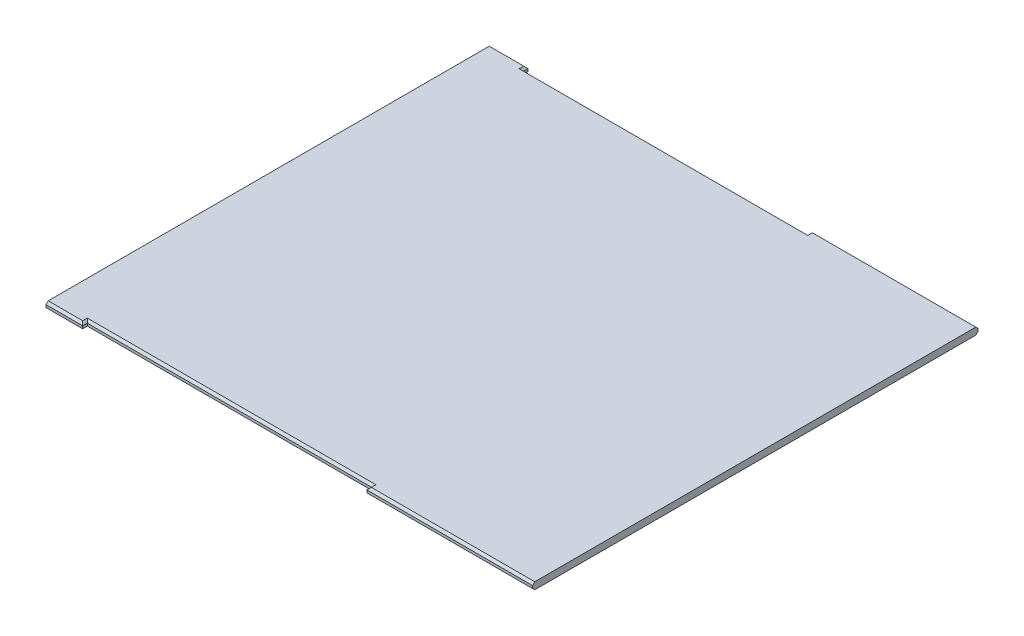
ISO-10303-21;
HEADER;
FILE_DESCRIPTION(('STEP AP214'),'2;1');
FILE_NAME('part.step','',(''),(''),'','','');
FILE_SCHEMA(('AUTOMOTIVE_DESIGN { 1 0 10303 214 1 1 1 1 }'));
ENDSEC;
DATA;
#1=APPLICATION_CONTEXT('core data for automotive mechanical design processes');
#2=APPLICATION_PROTOCOL_DEFINITION('international standard','automotive_design',2000,#1);
#3=PRODUCT_CONTEXT('',#1,'mechanical');
#4=PRODUCT('Part','Part','',(#3));
#5=PRODUCT_RELATED_PRODUCT_CATEGORY('part','',(#4));
#6=PRODUCT_DEFINITION_FORMATION('','',#4);
#7=PRODUCT_DEFINITION_CONTEXT('part definition',#1,'design');
#8=PRODUCT_DEFINITION('design','',#6,#7);
#9=PRODUCT_DEFINITION_SHAPE('','',#8);
#10=(LENGTH_UNIT() NAMED_UNIT(*) SI_UNIT(.MILLI.,.METRE.));
#11=(NAMED_UNIT(*) PLANE_ANGLE_UNIT() SI_UNIT($,.RADIAN.));
#12=(NAMED_UNIT(*) SI_UNIT($,.STERADIAN.) SOLID_ANGLE_UNIT());
#13=UNCERTAINTY_MEASURE_WITH_UNIT(LENGTH_MEASURE(1.E-05),#10,'distance_accuracy_value','');
#14=(GEOMETRIC_REPRESENTATION_CONTEXT(3) GLOBAL_UNCERTAINTY_ASSIGNED_CONTEXT((#13)) GLOBAL_UNIT_ASSIGNED_CONTEXT((#10,
#11,#12)) REPRESENTATION_CONTEXT('',''));
#15=CARTESIAN_POINT('',(0.,0.,0.));
#16=DIRECTION('',(0.,0.,1.));
#17=DIRECTION('',(1.,0.,0.));
#18=AXIS2_PLACEMENT_3D('',#15,#16,#17);
#19=CARTESIAN_POINT('',(-562.573544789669,9.525,-556.126720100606));
#20=DIRECTION('',(-1.,0.,0.));
#21=DIRECTION('',(0.,0.,1.));
#22=AXIS2_PLACEMENT_3D('',#19,#20,#21);
#23=PLANE('',#22);
#24=DIRECTION('',(0.,-1.,0.));
#25=VECTOR('',#24,1.);
#26=CARTESIAN_POINT('',(-562.573544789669,9.525,-556.126720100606));
#27=LINE('',#26,#25);
#28=CARTESIAN_POINT('',(-562.573544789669,3.525,-556.126720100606));
#29=VERTEX_POINT('',#28);
#30=CARTESIAN_POINT('',(-562.573544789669,-3.52499999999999,-556.126720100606));
#31=VERTEX_POINT('',#30);
#32=EDGE_CURVE('E462',#29,#31,#27,.T.);
#33=ORIENTED_EDGE('',*,*,#32,.T.);
#34=DIRECTION('',(0.,0.,-1.));
#35=VECTOR('',#34,1.);
#36=CARTESIAN_POINT('',(-562.573544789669,-3.525,-556.126720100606));
#37=LINE('',#36,#35);
#38=CARTESIAN_POINT('',(-562.573544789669,-3.52499999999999,-568.651720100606));
#39=VERTEX_POINT('',#38);
#40=EDGE_CURVE('E290',#31,#39,#37,.T.);
#41=ORIENTED_EDGE('',*,*,#40,.T.);
#42=DIRECTION('',(0.,-1.,0.));
#43=VECTOR('',#42,1.);
#44=CARTESIAN_POINT('',(-562.573544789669,9.525,-568.651720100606));
#45=LINE('',#44,#43);
#46=CARTESIAN_POINT('',(-562.573544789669,3.525,-568.651720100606));
#47=VERTEX_POINT('',#46);
#48=EDGE_CURVE('E231',#47,#39,#45,.T.);
#49=ORIENTED_EDGE('',*,*,#48,.F.);
#50=DIRECTION('',(0.,0.,1.));
#51=VECTOR('',#50,1.);
#52=CARTESIAN_POINT('',(-562.573544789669,3.525,-556.126720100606));
#53=LINE('',#52,#51);
#54=EDGE_CURVE('E288',#47,#29,#53,.T.);
#55=ORIENTED_EDGE('',*,*,#54,.T.);
#56=EDGE_LOOP('',(#33,#41,#49,#55));
#57=FACE_BOUND('',#56,.T.);
#58=ADVANCED_FACE('F50',(#57),#23,.F.);
#59=CARTESIAN_POINT('',(-562.573544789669,9.525,-568.651720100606));
#60=DIRECTION('',(0.,0.,1.));
#61=DIRECTION('',(1.,0.,0.));
#62=AXIS2_PLACEMENT_3D('',#59,#60,#61);
#63=PLANE('',#62);
#64=ORIENTED_EDGE('',*,*,#48,.T.);
#65=DIRECTION('',(-1.,0.,0.));
#66=VECTOR('',#65,1.);
#67=CARTESIAN_POINT('',(-562.573544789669,-3.525,-568.651720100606));
#68=LINE('',#67,#66);
#69=CARTESIAN_POINT('',(-662.573544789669,-3.52499999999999,-568.651720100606));
#70=VERTEX_POINT('',#69);
#71=EDGE_CURVE('E232',#39,#70,#68,.T.);
#72=ORIENTED_EDGE('',*,*,#71,.T.);
#73=DIRECTION('',(0.,-1.,0.));
#74=VECTOR('',#73,1.);
#75=CARTESIAN_POINT('',(-662.573544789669,9.525,-568.651720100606));
#76=LINE('',#75,#74);
#77=CARTESIAN_POINT('',(-662.573544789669,3.525,-568.651720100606));
#78=VERTEX_POINT('',#77);
#79=EDGE_CURVE('E214',#78,#70,#76,.T.);
#80=ORIENTED_EDGE('',*,*,#79,.F.);
#81=DIRECTION('',(1.,0.,0.));
#82=VECTOR('',#81,1.);
#83=CARTESIAN_POINT('',(-562.573544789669,3.525,-568.651720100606));
#84=LINE('',#83,#82);
#85=EDGE_CURVE('E226',#78,#47,#84,.T.);
#86=ORIENTED_EDGE('',*,*,#85,.T.);
#87=EDGE_LOOP('',(#64,#72,#80,#86));
#88=FACE_BOUND('',#87,.T.);
#89=ADVANCED_FACE('F229',(#88),#63,.F.);
#90=CARTESIAN_POINT('',(-662.573544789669,9.525,644.548279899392));
#91=DIRECTION('',(1.,0.,0.));
#92=DIRECTION('',(0.,0.,-1.));
#93=AXIS2_PLACEMENT_3D('',#90,#91,#92);
#94=PLANE('',#93);
#95=ORIENTED_EDGE('',*,*,#79,.T.);
#96=DIRECTION('',(0.,0.707106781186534,-0.707106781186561));
#97=VECTOR('',#96,1.);
#98=CARTESIAN_POINT('',(-662.573544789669,-3.525,-568.651720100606));
#99=LINE('',#98,#97);
#100=CARTESIAN_POINT('',(-662.573544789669,-9.525,-562.651720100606));
#101=VERTEX_POINT('',#100);
#102=EDGE_CURVE('E224',#70,#101,#99,.F.);
#103=ORIENTED_EDGE('',*,*,#102,.T.);
#104=DIRECTION('',(0.,0.,1.));
#105=VECTOR('',#104,1.);
#106=CARTESIAN_POINT('',(-662.573544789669,-9.525,644.548279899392));
#107=LINE('',#106,#105);
#108=CARTESIAN_POINT('',(-662.573544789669,-9.525,638.548279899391));
#109=VERTEX_POINT('',#108);
#110=EDGE_CURVE('E398',#101,#109,#107,.T.);
#111=ORIENTED_EDGE('',*,*,#110,.T.);
#112=DIRECTION('',(0.,-0.707106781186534,-0.707106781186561));
#113=VECTOR('',#112,1.);
#114=CARTESIAN_POINT('',(-662.573544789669,-3.525,644.548279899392));
#115=LINE('',#114,#113);
#116=CARTESIAN_POINT('',(-662.573544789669,-3.52499999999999,644.548279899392));
#117=VERTEX_POINT('',#116);
#118=EDGE_CURVE('E221',#109,#117,#115,.F.);
#119=ORIENTED_EDGE('',*,*,#118,.T.);
#120=DIRECTION('',(0.,-1.,0.));
#121=VECTOR('',#120,1.);
#122=CARTESIAN_POINT('',(-662.573544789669,9.525,644.548279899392));
#123=LINE('',#122,#121);
#124=CARTESIAN_POINT('',(-662.573544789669,3.525,644.548279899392));
#125=VERTEX_POINT('',#124);
#126=EDGE_CURVE('E237',#125,#117,#123,.T.);
#127=ORIENTED_EDGE('',*,*,#126,.F.);
#128=DIRECTION('',(0.,0.707106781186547,-0.707106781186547));
#129=VECTOR('',#128,1.);
#130=CARTESIAN_POINT('',(-662.573544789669,9.525,638.548279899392));
#131=LINE('',#130,#129);
#132=CARTESIAN_POINT('',(-662.573544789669,9.525,638.548279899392));
#133=VERTEX_POINT('',#132);
#134=EDGE_CURVE('E248',#125,#133,#131,.T.);
#135=ORIENTED_EDGE('',*,*,#134,.T.);
#136=DIRECTION('',(0.,0.,1.));
#137=VECTOR('',#136,1.);
#138=CARTESIAN_POINT('',(-662.573544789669,9.525,644.548279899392));
#139=LINE('',#138,#137);
#140=CARTESIAN_POINT('',(-662.573544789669,9.525,-562.651720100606));
#141=VERTEX_POINT('',#140);
#142=EDGE_CURVE('E220',#141,#133,#139,.T.);
#143=ORIENTED_EDGE('',*,*,#142,.F.);
#144=DIRECTION('',(0.,-0.707106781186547,-0.707106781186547));
#145=VECTOR('',#144,1.);
#146=CARTESIAN_POINT('',(-662.573544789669,9.525,-562.651720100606));
#147=LINE('',#146,#145);
#148=EDGE_CURVE('E215',#141,#78,#147,.T.);
#149=ORIENTED_EDGE('',*,*,#148,.T.);
#150=EDGE_LOOP('',(#95,#103,#111,#119,#127,#135,#143,#149));
#151=FACE_BOUND('',#150,.T.);
#152=ADVANCED_FACE('F212',(#151),#94,.F.);
#153=CARTESIAN_POINT('',(-562.573544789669,9.525,644.548279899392));
#154=DIRECTION('',(0.,0.,-1.));
#155=DIRECTION('',(-1.,0.,0.));
#156=AXIS2_PLACEMENT_3D('',#153,#154,#155);
#157=PLANE('',#156);
#158=ORIENTED_EDGE('',*,*,#126,.T.);
#159=DIRECTION('',(1.,0.,0.));
#160=VECTOR('',#159,1.);
#161=CARTESIAN_POINT('',(-562.573544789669,-3.525,644.548279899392));
#162=LINE('',#161,#160);
#163=CARTESIAN_POINT('',(-562.573544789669,-3.52499999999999,644.548279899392));
#164=VERTEX_POINT('',#163);
#165=EDGE_CURVE('E358',#117,#164,#162,.T.);
#166=ORIENTED_EDGE('',*,*,#165,.T.);
#167=DIRECTION('',(0.,-1.,0.));
#168=VECTOR('',#167,1.);
#169=CARTESIAN_POINT('',(-562.573544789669,9.525,644.548279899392));
#170=LINE('',#169,#168);
#171=CARTESIAN_POINT('',(-562.573544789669,3.525,644.548279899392));
#172=VERTEX_POINT('',#171);
#173=EDGE_CURVE('E498',#172,#164,#170,.T.);
#174=ORIENTED_EDGE('',*,*,#173,.F.);
#175=DIRECTION('',(-1.,0.,0.));
#176=VECTOR('',#175,1.);
#177=CARTESIAN_POINT('',(-662.573544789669,3.525,644.548279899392));
#178=LINE('',#177,#176);
#179=EDGE_CURVE('E353',#172,#125,#178,.T.);
#180=ORIENTED_EDGE('',*,*,#179,.T.);
#181=EDGE_LOOP('',(#158,#166,#174,#180));
#182=FACE_BOUND('',#181,.T.);
#183=ADVANCED_FACE('F510',(#182),#157,.F.);
#184=CARTESIAN_POINT('',(-562.573544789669,9.525,632.023279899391));
#185=DIRECTION('',(-1.,0.,0.));
#186=DIRECTION('',(0.,0.,1.));
#187=AXIS2_PLACEMENT_3D('',#184,#185,#186);
#188=PLANE('',#187);
#189=ORIENTED_EDGE('',*,*,#173,.T.);
#190=DIRECTION('',(0.,0.,-1.));
#191=VECTOR('',#190,1.);
#192=CARTESIAN_POINT('',(-562.573544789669,-3.525,632.023279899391));
#193=LINE('',#192,#191);
#194=CARTESIAN_POINT('',(-562.573544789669,-3.52499999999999,632.023279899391));
#195=VERTEX_POINT('',#194);
#196=EDGE_CURVE('E361',#164,#195,#193,.T.);
#197=ORIENTED_EDGE('',*,*,#196,.T.);
#198=DIRECTION('',(0.,-1.,0.));
#199=VECTOR('',#198,1.);
#200=CARTESIAN_POINT('',(-562.573544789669,9.525,632.023279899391));
#201=LINE('',#200,#199);
#202=CARTESIAN_POINT('',(-562.573544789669,3.525,632.023279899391));
#203=VERTEX_POINT('',#202);
#204=EDGE_CURVE('E497',#203,#195,#201,.T.);
#205=ORIENTED_EDGE('',*,*,#204,.F.);
#206=DIRECTION('',(0.,0.,1.));
#207=VECTOR('',#206,1.);
#208=CARTESIAN_POINT('',(-562.573544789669,3.525,644.548279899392));
#209=LINE('',#208,#207);
#210=EDGE_CURVE('E356',#203,#172,#209,.T.);
#211=ORIENTED_EDGE('',*,*,#210,.T.);
#212=EDGE_LOOP('',(#189,#197,#205,#211));
#213=FACE_BOUND('',#212,.T.);
#214=ADVANCED_FACE('F521',(#213),#188,.F.);
#215=CARTESIAN_POINT('',(211.426455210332,9.525,632.023279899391));
#216=DIRECTION('',(0.,0.,-1.));
#217=DIRECTION('',(-1.,0.,0.));
#218=AXIS2_PLACEMENT_3D('',#215,#216,#217);
#219=PLANE('',#218);
#220=ORIENTED_EDGE('',*,*,#204,.T.);
#221=DIRECTION('',(1.,0.,0.));
#222=VECTOR('',#221,1.);
#223=CARTESIAN_POINT('',(211.426455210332,-3.525,632.023279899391));
#224=LINE('',#223,#222);
#225=CARTESIAN_POINT('',(211.426455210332,-3.52499999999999,632.023279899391));
#226=VERTEX_POINT('',#225);
#227=EDGE_CURVE('E369',#195,#226,#224,.T.);
#228=ORIENTED_EDGE('',*,*,#227,.T.);
#229=DIRECTION('',(0.,-1.,0.));
#230=VECTOR('',#229,1.);
#231=CARTESIAN_POINT('',(211.426455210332,9.525,632.023279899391));
#232=LINE('',#231,#230);
#233=CARTESIAN_POINT('',(211.426455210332,3.525,632.023279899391));
#234=VERTEX_POINT('',#233);
#235=EDGE_CURVE('E492',#234,#226,#232,.T.);
#236=ORIENTED_EDGE('',*,*,#235,.F.);
#237=DIRECTION('',(-1.,0.,0.));
#238=VECTOR('',#237,1.);
#239=CARTESIAN_POINT('',(-562.573544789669,3.525,632.023279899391));
#240=LINE('',#239,#238);
#241=EDGE_CURVE('E368',#234,#203,#240,.T.);
#242=ORIENTED_EDGE('',*,*,#241,.T.);
#243=EDGE_LOOP('',(#220,#228,#236,#242));
#244=FACE_BOUND('',#243,.T.);
#245=ADVANCED_FACE('F530',(#244),#219,.F.);
#246=CARTESIAN_POINT('',(211.426455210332,9.525,632.023279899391));
#247=DIRECTION('',(1.,0.,0.));
#248=DIRECTION('',(0.,0.,-1.));
#249=AXIS2_PLACEMENT_3D('',#246,#247,#248);
#250=PLANE('',#249);
#251=ORIENTED_EDGE('',*,*,#235,.T.);
#252=DIRECTION('',(0.,0.,1.));
#253=VECTOR('',#252,1.);
#254=CARTESIAN_POINT('',(211.426455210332,-3.525,632.023279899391));
#255=LINE('',#254,#253);
#256=CARTESIAN_POINT('',(211.426455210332,-3.52499999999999,644.548279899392));
#257=VERTEX_POINT('',#256);
#258=EDGE_CURVE('E68',#226,#257,#255,.T.);
#259=ORIENTED_EDGE('',*,*,#258,.T.);
#260=DIRECTION('',(0.,-1.,0.));
#261=VECTOR('',#260,1.);
#262=CARTESIAN_POINT('',(211.426455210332,9.525,644.548279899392));
#263=LINE('',#262,#261);
#264=CARTESIAN_POINT('',(211.426455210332,3.525,644.548279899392));
#265=VERTEX_POINT('',#264);
#266=EDGE_CURVE('E489',#265,#257,#263,.T.);
#267=ORIENTED_EDGE('',*,*,#266,.F.);
#268=DIRECTION('',(0.,0.,-1.));
#269=VECTOR('',#268,1.);
#270=CARTESIAN_POINT('',(211.426455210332,3.525,632.023279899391));
#271=LINE('',#270,#269);
#272=EDGE_CURVE('E375',#265,#234,#271,.T.);
#273=ORIENTED_EDGE('',*,*,#272,.T.);
#274=EDGE_LOOP('',(#251,#259,#267,#273));
#275=FACE_BOUND('',#274,.T.);
#276=ADVANCED_FACE('F837',(#275),#250,.F.);
#277=CARTESIAN_POINT('',(211.426455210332,9.525,644.548279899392));
#278=DIRECTION('',(0.,0.,-1.));
#279=DIRECTION('',(-1.,0.,0.));
#280=AXIS2_PLACEMENT_3D('',#277,#278,#279);
#281=PLANE('',#280);
#282=ORIENTED_EDGE('',*,*,#266,.T.);
#283=DIRECTION('',(1.,0.,0.));
#284=VECTOR('',#283,1.);
#285=CARTESIAN_POINT('',(211.426455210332,-3.525,644.548279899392));
#286=LINE('',#285,#284);
#287=CARTESIAN_POINT('',(662.626455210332,-3.52499999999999,644.548279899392));
#288=VERTEX_POINT('',#287);
#289=EDGE_CURVE('E11',#257,#288,#286,.T.);
#290=ORIENTED_EDGE('',*,*,#289,.T.);
#291=DIRECTION('',(0.,-1.,0.));
#292=VECTOR('',#291,1.);
#293=CARTESIAN_POINT('',(662.626455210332,9.525,644.548279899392));
#294=LINE('',#293,#292);
#295=CARTESIAN_POINT('',(662.626455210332,3.525,644.548279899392));
#296=VERTEX_POINT('',#295);
#297=EDGE_CURVE('E490',#296,#288,#294,.T.);
#298=ORIENTED_EDGE('',*,*,#297,.F.);
#299=DIRECTION('',(-1.,0.,0.));
#300=VECTOR('',#299,1.);
#301=CARTESIAN_POINT('',(211.426455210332,3.525,644.548279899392));
#302=LINE('',#301,#300);
#303=EDGE_CURVE('E59',#296,#265,#302,.T.);
#304=ORIENTED_EDGE('',*,*,#303,.T.);
#305=EDGE_LOOP('',(#282,#290,#298,#304));
#306=FACE_BOUND('',#305,.T.);
#307=ADVANCED_FACE('F542',(#306),#281,.F.);
#308=CARTESIAN_POINT('',(662.626455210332,9.525,644.548279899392));
#309=DIRECTION('',(-1.,0.,0.));
#310=DIRECTION('',(0.,0.,1.));
#311=AXIS2_PLACEMENT_3D('',#308,#309,#310);
#312=PLANE('',#311);
#313=DIRECTION('',(0.,0.,-1.));
#314=VECTOR('',#313,1.);
#315=CARTESIAN_POINT('',(662.626455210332,-9.525,644.548279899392));
#316=LINE('',#315,#314);
#317=CARTESIAN_POINT('',(662.626455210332,-9.525,638.548279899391));
#318=VERTEX_POINT('',#317);
#319=CARTESIAN_POINT('',(662.626455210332,-9.525,-562.651720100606));
#320=VERTEX_POINT('',#319);
#321=EDGE_CURVE('E467',#318,#320,#316,.T.);
#322=ORIENTED_EDGE('',*,*,#321,.T.);
#323=DIRECTION('',(0.,-0.707106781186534,0.707106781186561));
#324=VECTOR('',#323,1.);
#325=CARTESIAN_POINT('',(662.626455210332,-3.525,-568.651720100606));
#326=LINE('',#325,#324);
#327=CARTESIAN_POINT('',(662.626455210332,-3.52499999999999,-568.651720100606));
#328=VERTEX_POINT('',#327);
#329=EDGE_CURVE('E317',#320,#328,#326,.F.);
#330=ORIENTED_EDGE('',*,*,#329,.T.);
#331=DIRECTION('',(0.,-1.,0.));
#332=VECTOR('',#331,1.);
#333=CARTESIAN_POINT('',(662.626455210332,9.525,-568.651720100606));
#334=LINE('',#333,#332);
#335=CARTESIAN_POINT('',(662.626455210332,3.525,-568.651720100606));
#336=VERTEX_POINT('',#335);
#337=EDGE_CURVE('E483',#336,#328,#334,.T.);
#338=ORIENTED_EDGE('',*,*,#337,.F.);
#339=DIRECTION('',(0.,0.707106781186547,0.707106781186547));
#340=VECTOR('',#339,1.);
#341=CARTESIAN_POINT('',(662.626455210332,9.525,-562.651720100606));
#342=LINE('',#341,#340);
#343=CARTESIAN_POINT('',(662.626455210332,9.525,-562.651720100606));
#344=VERTEX_POINT('',#343);
#345=EDGE_CURVE('E316',#336,#344,#342,.T.);
#346=ORIENTED_EDGE('',*,*,#345,.T.);
#347=DIRECTION('',(0.,0.,-1.));
#348=VECTOR('',#347,1.);
#349=CARTESIAN_POINT('',(662.626455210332,9.525,644.548279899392));
#350=LINE('',#349,#348);
#351=CARTESIAN_POINT('',(662.626455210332,9.525,638.548279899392));
#352=VERTEX_POINT('',#351);
#353=EDGE_CURVE('E454',#352,#344,#350,.T.);
#354=ORIENTED_EDGE('',*,*,#353,.F.);
#355=DIRECTION('',(0.,-0.707106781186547,0.707106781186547));
#356=VECTOR('',#355,1.);
#357=CARTESIAN_POINT('',(662.626455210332,9.525,638.548279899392));
#358=LINE('',#357,#356);
#359=EDGE_CURVE('E309',#352,#296,#358,.T.);
#360=ORIENTED_EDGE('',*,*,#359,.T.);
#361=ORIENTED_EDGE('',*,*,#297,.T.);
#362=DIRECTION('',(0.,0.707106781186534,0.707106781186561));
#363=VECTOR('',#362,1.);
#364=CARTESIAN_POINT('',(662.626455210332,-3.525,644.548279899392));
#365=LINE('',#364,#363);
#366=EDGE_CURVE('E311',#288,#318,#365,.F.);
#367=ORIENTED_EDGE('',*,*,#366,.T.);
#368=EDGE_LOOP('',(#322,#330,#338,#346,#354,#360,#361,#367));
#369=FACE_BOUND('',#368,.T.);
#370=ADVANCED_FACE('F457',(#369),#312,.F.);
#371=CARTESIAN_POINT('',(211.426455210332,9.525,-568.651720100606));
#372=DIRECTION('',(0.,0.,1.));
#373=DIRECTION('',(1.,0.,0.));
#374=AXIS2_PLACEMENT_3D('',#371,#372,#373);
#375=PLANE('',#374);
#376=ORIENTED_EDGE('',*,*,#337,.T.);
#377=DIRECTION('',(-1.,0.,0.));
#378=VECTOR('',#377,1.);
#379=CARTESIAN_POINT('',(211.426455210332,-3.525,-568.651720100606));
#380=LINE('',#379,#378);
#381=CARTESIAN_POINT('',(211.426455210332,-3.52499999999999,-568.651720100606));
#382=VERTEX_POINT('',#381);
#383=EDGE_CURVE('E307',#328,#382,#380,.T.);
#384=ORIENTED_EDGE('',*,*,#383,.T.);
#385=DIRECTION('',(0.,-1.,0.));
#386=VECTOR('',#385,1.);
#387=CARTESIAN_POINT('',(211.426455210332,9.525,-568.651720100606));
#388=LINE('',#387,#386);
#389=CARTESIAN_POINT('',(211.426455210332,3.525,-568.651720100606));
#390=VERTEX_POINT('',#389);
#391=EDGE_CURVE('E479',#390,#382,#388,.T.);
#392=ORIENTED_EDGE('',*,*,#391,.F.);
#393=DIRECTION('',(1.,0.,0.));
#394=VECTOR('',#393,1.);
#395=CARTESIAN_POINT('',(662.626455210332,3.525,-568.651720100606));
#396=LINE('',#395,#394);
#397=EDGE_CURVE('E305',#390,#336,#396,.T.);
#398=ORIENTED_EDGE('',*,*,#397,.T.);
#399=EDGE_LOOP('',(#376,#384,#392,#398));
#400=FACE_BOUND('',#399,.T.);
#401=ADVANCED_FACE('F584',(#400),#375,.F.);
#402=CARTESIAN_POINT('',(211.426455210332,9.525,-556.126720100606));
#403=DIRECTION('',(1.,0.,0.));
#404=DIRECTION('',(0.,0.,-1.));
#405=AXIS2_PLACEMENT_3D('',#402,#403,#404);
#406=PLANE('',#405);
#407=ORIENTED_EDGE('',*,*,#391,.T.);
#408=DIRECTION('',(0.,0.,1.));
#409=VECTOR('',#408,1.);
#410=CARTESIAN_POINT('',(211.426455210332,-3.525,-556.126720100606));
#411=LINE('',#410,#409);
#412=CARTESIAN_POINT('',(211.426455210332,-3.52499999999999,-556.126720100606));
#413=VERTEX_POINT('',#412);
#414=EDGE_CURVE('E303',#382,#413,#411,.T.);
#415=ORIENTED_EDGE('',*,*,#414,.T.);
#416=DIRECTION('',(0.,-1.,0.));
#417=VECTOR('',#416,1.);
#418=CARTESIAN_POINT('',(211.426455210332,9.525,-556.126720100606));
#419=LINE('',#418,#417);
#420=CARTESIAN_POINT('',(211.426455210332,3.525,-556.126720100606));
#421=VERTEX_POINT('',#420);
#422=EDGE_CURVE('E468',#421,#413,#419,.T.);
#423=ORIENTED_EDGE('',*,*,#422,.F.);
#424=DIRECTION('',(0.,0.,-1.));
#425=VECTOR('',#424,1.);
#426=CARTESIAN_POINT('',(211.426455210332,3.525,-568.651720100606));
#427=LINE('',#426,#425);
#428=EDGE_CURVE('E298',#421,#390,#427,.T.);
#429=ORIENTED_EDGE('',*,*,#428,.T.);
#430=EDGE_LOOP('',(#407,#415,#423,#429));
#431=FACE_BOUND('',#430,.T.);
#432=ADVANCED_FACE('F562',(#431),#406,.F.);
#433=CARTESIAN_POINT('',(211.426455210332,9.525,-556.126720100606));
#434=DIRECTION('',(0.,0.,1.));
#435=DIRECTION('',(1.,0.,0.));
#436=AXIS2_PLACEMENT_3D('',#433,#434,#435);
#437=PLANE('',#436);
#438=ORIENTED_EDGE('',*,*,#422,.T.);
#439=DIRECTION('',(-1.,0.,0.));
#440=VECTOR('',#439,1.);
#441=CARTESIAN_POINT('',(211.426455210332,-3.525,-556.126720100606));
#442=LINE('',#441,#440);
#443=EDGE_CURVE('E293',#413,#31,#442,.T.);
#444=ORIENTED_EDGE('',*,*,#443,.T.);
#445=ORIENTED_EDGE('',*,*,#32,.F.);
#446=DIRECTION('',(1.,0.,0.));
#447=VECTOR('',#446,1.);
#448=CARTESIAN_POINT('',(211.426455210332,3.525,-556.126720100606));
#449=LINE('',#448,#447);
#450=EDGE_CURVE('E295',#29,#421,#449,.T.);
#451=ORIENTED_EDGE('',*,*,#450,.T.);
#452=EDGE_LOOP('',(#438,#444,#445,#451));
#453=FACE_BOUND('',#452,.T.);
#454=ADVANCED_FACE('F570',(#453),#437,.F.);
#455=CARTESIAN_POINT('',(0.,9.525,0.));
#456=DIRECTION('',(0.,1.,0.));
#457=DIRECTION('',(0.,0.,1.));
#458=AXIS2_PLACEMENT_3D('',#455,#456,#457);
#459=PLANE('',#458);
#460=DIRECTION('',(0.,0.,-1.));
#461=VECTOR('',#460,1.);
#462=CARTESIAN_POINT('',(-568.573544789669,9.525,-568.651720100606));
#463=LINE('',#462,#461);
#464=CARTESIAN_POINT('',(-568.573544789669,9.525,-550.126720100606));
#465=VERTEX_POINT('',#464);
#466=CARTESIAN_POINT('',(-568.573544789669,9.525,-562.651720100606));
#467=VERTEX_POINT('',#466);
#468=EDGE_CURVE('E350',#465,#467,#463,.T.);
#469=ORIENTED_EDGE('',*,*,#468,.T.);
#470=DIRECTION('',(-1.,0.,0.));
#471=VECTOR('',#470,1.);
#472=CARTESIAN_POINT('',(-662.573544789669,9.525,-562.651720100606));
#473=LINE('',#472,#471);
#474=EDGE_CURVE('E348',#467,#141,#473,.T.);
#475=ORIENTED_EDGE('',*,*,#474,.T.);
#476=ORIENTED_EDGE('',*,*,#142,.T.);
#477=DIRECTION('',(1.,0.,0.));
#478=VECTOR('',#477,1.);
#479=CARTESIAN_POINT('',(-562.573544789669,9.525,638.548279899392));
#480=LINE('',#479,#478);
#481=CARTESIAN_POINT('',(-568.573544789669,9.525,638.548279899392));
#482=VERTEX_POINT('',#481);
#483=EDGE_CURVE('E331',#133,#482,#480,.T.);
#484=ORIENTED_EDGE('',*,*,#483,.T.);
#485=DIRECTION('',(0.,0.,-1.));
#486=VECTOR('',#485,1.);
#487=CARTESIAN_POINT('',(-568.573544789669,9.525,632.023279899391));
#488=LINE('',#487,#486);
#489=CARTESIAN_POINT('',(-568.573544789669,9.525,626.023279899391));
#490=VERTEX_POINT('',#489);
#491=EDGE_CURVE('E332',#482,#490,#488,.T.);
#492=ORIENTED_EDGE('',*,*,#491,.T.);
#493=DIRECTION('',(1.,0.,0.));
#494=VECTOR('',#493,1.);
#495=CARTESIAN_POINT('',(211.426455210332,9.525,626.023279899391));
#496=LINE('',#495,#494);
#497=CARTESIAN_POINT('',(217.426455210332,9.525,626.023279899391));
#498=VERTEX_POINT('',#497);
#499=EDGE_CURVE('E327',#490,#498,#496,.T.);
#500=ORIENTED_EDGE('',*,*,#499,.T.);
#501=DIRECTION('',(0.,0.,1.));
#502=VECTOR('',#501,1.);
#503=CARTESIAN_POINT('',(217.426455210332,9.525,644.548279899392));
#504=LINE('',#503,#502);
#505=CARTESIAN_POINT('',(217.426455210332,9.525,638.548279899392));
#506=VERTEX_POINT('',#505);
#507=EDGE_CURVE('E324',#498,#506,#504,.T.);
#508=ORIENTED_EDGE('',*,*,#507,.T.);
#509=DIRECTION('',(1.,0.,0.));
#510=VECTOR('',#509,1.);
#511=CARTESIAN_POINT('',(662.626455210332,9.525,638.548279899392));
#512=LINE('',#511,#510);
#513=EDGE_CURVE('E325',#506,#352,#512,.T.);
#514=ORIENTED_EDGE('',*,*,#513,.T.);
#515=ORIENTED_EDGE('',*,*,#353,.T.);
#516=DIRECTION('',(-1.,0.,0.));
#517=VECTOR('',#516,1.);
#518=CARTESIAN_POINT('',(211.426455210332,9.525,-562.651720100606));
#519=LINE('',#518,#517);
#520=CARTESIAN_POINT('',(217.426455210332,9.525,-562.651720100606));
#521=VERTEX_POINT('',#520);
#522=EDGE_CURVE('E343',#344,#521,#519,.T.);
#523=ORIENTED_EDGE('',*,*,#522,.T.);
#524=DIRECTION('',(0.,0.,1.));
#525=VECTOR('',#524,1.);
#526=CARTESIAN_POINT('',(217.426455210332,9.525,-556.126720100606));
#527=LINE('',#526,#525);
#528=CARTESIAN_POINT('',(217.426455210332,9.525,-550.126720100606));
#529=VERTEX_POINT('',#528);
#530=EDGE_CURVE('E338',#521,#529,#527,.T.);
#531=ORIENTED_EDGE('',*,*,#530,.T.);
#532=DIRECTION('',(-1.,0.,0.));
#533=VECTOR('',#532,1.);
#534=CARTESIAN_POINT('',(-562.573544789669,9.525,-550.126720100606));
#535=LINE('',#534,#533);
#536=EDGE_CURVE('E345',#529,#465,#535,.T.);
#537=ORIENTED_EDGE('',*,*,#536,.T.);
#538=EDGE_LOOP('',(#469,#475,#476,#484,#492,#500,#508,#514,#515,#523,#531,#537));
#539=FACE_BOUND('',#538,.T.);
#540=ADVANCED_FACE('F453',(#539),#459,.T.);
#541=CARTESIAN_POINT('',(0.,-9.525,0.));
#542=DIRECTION('',(0.,1.,0.));
#543=DIRECTION('',(0.,0.,1.));
#544=AXIS2_PLACEMENT_3D('',#541,#542,#543);
#545=PLANE('',#544);
#546=ORIENTED_EDGE('',*,*,#110,.F.);
#547=DIRECTION('',(1.,0.,0.));
#548=VECTOR('',#547,1.);
#549=CARTESIAN_POINT('',(0.,-9.525,-562.651720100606));
#550=LINE('',#549,#548);
#551=CARTESIAN_POINT('',(-568.573544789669,-9.525,-562.651720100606));
#552=VERTEX_POINT('',#551);
#553=EDGE_CURVE('E283',#101,#552,#550,.T.);
#554=ORIENTED_EDGE('',*,*,#553,.T.);
#555=DIRECTION('',(0.,0.,1.));
#556=VECTOR('',#555,1.);
#557=CARTESIAN_POINT('',(-568.573544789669,-9.525,0.));
#558=LINE('',#557,#556);
#559=CARTESIAN_POINT('',(-568.573544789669,-9.525,-550.126720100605));
#560=VERTEX_POINT('',#559);
#561=EDGE_CURVE('E278',#552,#560,#558,.T.);
#562=ORIENTED_EDGE('',*,*,#561,.T.);
#563=DIRECTION('',(1.,0.,0.));
#564=VECTOR('',#563,1.);
#565=CARTESIAN_POINT('',(0.,-9.525,-550.126720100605));
#566=LINE('',#565,#564);
#567=CARTESIAN_POINT('',(217.426455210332,-9.525,-550.126720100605));
#568=VERTEX_POINT('',#567);
#569=EDGE_CURVE('E280',#560,#568,#566,.T.);
#570=ORIENTED_EDGE('',*,*,#569,.T.);
#571=DIRECTION('',(0.,0.,-1.));
#572=VECTOR('',#571,1.);
#573=CARTESIAN_POINT('',(217.426455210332,-9.525,0.));
#574=LINE('',#573,#572);
#575=CARTESIAN_POINT('',(217.426455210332,-9.525,-562.651720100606));
#576=VERTEX_POINT('',#575);
#577=EDGE_CURVE('E273',#568,#576,#574,.T.);
#578=ORIENTED_EDGE('',*,*,#577,.T.);
#579=DIRECTION('',(1.,0.,0.));
#580=VECTOR('',#579,1.);
#581=CARTESIAN_POINT('',(0.,-9.525,-562.651720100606));
#582=LINE('',#581,#580);
#583=EDGE_CURVE('E271',#576,#320,#582,.T.);
#584=ORIENTED_EDGE('',*,*,#583,.T.);
#585=ORIENTED_EDGE('',*,*,#321,.F.);
#586=DIRECTION('',(-1.,0.,0.));
#587=VECTOR('',#586,1.);
#588=CARTESIAN_POINT('',(0.,-9.525,638.548279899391));
#589=LINE('',#588,#587);
#590=CARTESIAN_POINT('',(217.426455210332,-9.525,638.548279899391));
#591=VERTEX_POINT('',#590);
#592=EDGE_CURVE('E258',#318,#591,#589,.T.);
#593=ORIENTED_EDGE('',*,*,#592,.T.);
#594=DIRECTION('',(0.,0.,-1.));
#595=VECTOR('',#594,1.);
#596=CARTESIAN_POINT('',(217.426455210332,-9.525,0.));
#597=LINE('',#596,#595);
#598=CARTESIAN_POINT('',(217.426455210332,-9.525,626.023279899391));
#599=VERTEX_POINT('',#598);
#600=EDGE_CURVE('E259',#591,#599,#597,.T.);
#601=ORIENTED_EDGE('',*,*,#600,.T.);
#602=DIRECTION('',(-1.,0.,0.));
#603=VECTOR('',#602,1.);
#604=CARTESIAN_POINT('',(0.,-9.525,626.023279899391));
#605=LINE('',#604,#603);
#606=CARTESIAN_POINT('',(-568.573544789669,-9.525,626.023279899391));
#607=VERTEX_POINT('',#606);
#608=EDGE_CURVE('E265',#599,#607,#605,.T.);
#609=ORIENTED_EDGE('',*,*,#608,.T.);
#610=DIRECTION('',(0.,0.,1.));
#611=VECTOR('',#610,1.);
#612=CARTESIAN_POINT('',(-568.573544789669,-9.525,0.));
#613=LINE('',#612,#611);
#614=CARTESIAN_POINT('',(-568.573544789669,-9.525,638.548279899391));
#615=VERTEX_POINT('',#614);
#616=EDGE_CURVE('E264',#607,#615,#613,.T.);
#617=ORIENTED_EDGE('',*,*,#616,.T.);
#618=DIRECTION('',(-1.,0.,0.));
#619=VECTOR('',#618,1.);
#620=CARTESIAN_POINT('',(0.,-9.525,638.548279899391));
#621=LINE('',#620,#619);
#622=EDGE_CURVE('E268',#615,#109,#621,.T.);
#623=ORIENTED_EDGE('',*,*,#622,.T.);
#624=EDGE_LOOP('',(#546,#554,#562,#570,#578,#584,#585,#593,#601,#609,#617,#623));
#625=FACE_BOUND('',#624,.T.);
#626=ADVANCED_FACE('F548',(#625),#545,.F.);
#627=CARTESIAN_POINT('',(211.426455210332,-3.525,-568.651720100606));
#628=DIRECTION('',(0.,0.707106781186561,0.707106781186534));
#629=DIRECTION('',(-1.,0.,0.));
#630=AXIS2_PLACEMENT_3D('',#627,#628,#629);
#631=PLANE('',#630);
#632=ORIENTED_EDGE('',*,*,#329,.F.);
#633=ORIENTED_EDGE('',*,*,#583,.F.);
#634=DIRECTION('',(-0.577350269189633,0.577350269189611,-0.577350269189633));
#635=VECTOR('',#634,1.);
#636=CARTESIAN_POINT('',(211.426455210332,-3.525,-568.651720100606));
#637=LINE('',#636,#635);
#638=EDGE_CURVE('E395',#382,#576,#637,.F.);
#639=ORIENTED_EDGE('',*,*,#638,.F.);
#640=ORIENTED_EDGE('',*,*,#383,.F.);
#641=EDGE_LOOP('',(#632,#633,#639,#640));
#642=FACE_BOUND('',#641,.T.);
#643=ADVANCED_FACE('F551',(#642),#631,.F.);
#644=CARTESIAN_POINT('',(211.426455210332,-3.525,-556.126720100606));
#645=DIRECTION('',(0.707106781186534,0.707106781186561,0.));
#646=DIRECTION('',(0.,0.,1.));
#647=AXIS2_PLACEMENT_3D('',#644,#645,#646);
#648=PLANE('',#647);
#649=ORIENTED_EDGE('',*,*,#638,.T.);
#650=ORIENTED_EDGE('',*,*,#577,.F.);
#651=DIRECTION('',(-0.577350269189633,0.577350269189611,-0.577350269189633));
#652=VECTOR('',#651,1.);
#653=CARTESIAN_POINT('',(211.426455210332,-3.525,-556.126720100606));
#654=LINE('',#653,#652);
#655=EDGE_CURVE('E389',#413,#568,#654,.F.);
#656=ORIENTED_EDGE('',*,*,#655,.F.);
#657=ORIENTED_EDGE('',*,*,#414,.F.);
#658=EDGE_LOOP('',(#649,#650,#656,#657));
#659=FACE_BOUND('',#658,.T.);
#660=ADVANCED_FACE('F558',(#659),#648,.F.);
#661=CARTESIAN_POINT('',(211.426455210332,-3.525,-556.126720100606));
#662=DIRECTION('',(0.,0.707106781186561,0.707106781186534));
#663=DIRECTION('',(-1.,0.,0.));
#664=AXIS2_PLACEMENT_3D('',#661,#662,#663);
#665=PLANE('',#664);
#666=ORIENTED_EDGE('',*,*,#655,.T.);
#667=ORIENTED_EDGE('',*,*,#569,.F.);
#668=DIRECTION('',(0.577350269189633,0.577350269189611,-0.577350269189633));
#669=VECTOR('',#668,1.);
#670=CARTESIAN_POINT('',(-562.573544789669,-3.525,-556.126720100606));
#671=LINE('',#670,#669);
#672=EDGE_CURVE('E382',#31,#560,#671,.F.);
#673=ORIENTED_EDGE('',*,*,#672,.F.);
#674=ORIENTED_EDGE('',*,*,#443,.F.);
#675=EDGE_LOOP('',(#666,#667,#673,#674));
#676=FACE_BOUND('',#675,.T.);
#677=ADVANCED_FACE('F620',(#676),#665,.F.);
#678=CARTESIAN_POINT('',(-562.573544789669,-3.525,-556.126720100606));
#679=DIRECTION('',(-0.707106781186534,0.707106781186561,0.));
#680=DIRECTION('',(0.,0.,-1.));
#681=AXIS2_PLACEMENT_3D('',#678,#679,#680);
#682=PLANE('',#681);
#683=ORIENTED_EDGE('',*,*,#672,.T.);
#684=ORIENTED_EDGE('',*,*,#561,.F.);
#685=DIRECTION('',(0.577350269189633,0.577350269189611,-0.577350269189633));
#686=VECTOR('',#685,1.);
#687=CARTESIAN_POINT('',(-566.748544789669,-7.69999999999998,-564.476720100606));
#688=LINE('',#687,#686);
#689=EDGE_CURVE('E377',#39,#552,#688,.F.);
#690=ORIENTED_EDGE('',*,*,#689,.F.);
#691=ORIENTED_EDGE('',*,*,#40,.F.);
#692=EDGE_LOOP('',(#683,#684,#690,#691));
#693=FACE_BOUND('',#692,.T.);
#694=ADVANCED_FACE('F596',(#693),#682,.F.);
#695=CARTESIAN_POINT('',(-562.573544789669,-3.525,-568.651720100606));
#696=DIRECTION('',(0.,0.707106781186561,0.707106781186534));
#697=DIRECTION('',(-1.,0.,0.));
#698=AXIS2_PLACEMENT_3D('',#695,#696,#697);
#699=PLANE('',#698);
#700=ORIENTED_EDGE('',*,*,#689,.T.);
#701=ORIENTED_EDGE('',*,*,#553,.F.);
#702=ORIENTED_EDGE('',*,*,#102,.F.);
#703=ORIENTED_EDGE('',*,*,#71,.F.);
#704=EDGE_LOOP('',(#700,#701,#702,#703));
#705=FACE_BOUND('',#704,.T.);
#706=ADVANCED_FACE('F589',(#705),#699,.F.);
#707=CARTESIAN_POINT('',(0.,9.525,-562.651720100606));
#708=DIRECTION('',(0.,0.707106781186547,-0.707106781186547));
#709=DIRECTION('',(1.,0.,0.));
#710=AXIS2_PLACEMENT_3D('',#707,#708,#709);
#711=PLANE('',#710);
#712=ORIENTED_EDGE('',*,*,#345,.F.);
#713=ORIENTED_EDGE('',*,*,#397,.F.);
#714=DIRECTION('',(-0.577350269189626,-0.577350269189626,-0.577350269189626));
#715=VECTOR('',#714,1.);
#716=CARTESIAN_POINT('',(404.977028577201,197.075573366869,-375.101146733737));
#717=LINE('',#716,#715);
#718=EDGE_CURVE('E383',#521,#390,#717,.T.);
#719=ORIENTED_EDGE('',*,*,#718,.F.);
#720=ORIENTED_EDGE('',*,*,#522,.F.);
#721=EDGE_LOOP('',(#712,#713,#719,#720));
#722=FACE_BOUND('',#721,.T.);
#723=ADVANCED_FACE('F590',(#722),#711,.T.);
#724=CARTESIAN_POINT('',(217.426455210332,9.525,0.));
#725=DIRECTION('',(-0.707106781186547,0.707106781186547,0.));
#726=DIRECTION('',(0.,0.,-1.));
#727=AXIS2_PLACEMENT_3D('',#724,#725,#726);
#728=PLANE('',#727);
#729=ORIENTED_EDGE('',*,*,#718,.T.);
#730=ORIENTED_EDGE('',*,*,#428,.F.);
#731=DIRECTION('',(0.577350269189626,0.577350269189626,0.577350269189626));
#732=VECTOR('',#731,1.);
#733=CARTESIAN_POINT('',(144.950970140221,-62.9504850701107,-622.602205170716));
#734=LINE('',#733,#732);
#735=EDGE_CURVE('E404',#529,#421,#734,.F.);
#736=ORIENTED_EDGE('',*,*,#735,.F.);
#737=ORIENTED_EDGE('',*,*,#530,.F.);
#738=EDGE_LOOP('',(#729,#730,#736,#737));
#739=FACE_BOUND('',#738,.T.);
#740=ADVANCED_FACE('F582',(#739),#728,.T.);
#741=CARTESIAN_POINT('',(0.,9.525,-550.126720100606));
#742=DIRECTION('',(0.,0.707106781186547,-0.707106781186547));
#743=DIRECTION('',(1.,0.,0.));
#744=AXIS2_PLACEMENT_3D('',#741,#742,#743);
#745=PLANE('',#744);
#746=ORIENTED_EDGE('',*,*,#735,.T.);
#747=ORIENTED_EDGE('',*,*,#450,.F.);
#748=DIRECTION('',(-0.577350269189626,0.577350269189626,0.577350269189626));
#749=VECTOR('',#748,1.);
#750=CARTESIAN_POINT('',(-751.949118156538,192.900573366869,-366.751146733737));
#751=LINE('',#750,#749);
#752=EDGE_CURVE('E400',#465,#29,#751,.F.);
#753=ORIENTED_EDGE('',*,*,#752,.F.);
#754=ORIENTED_EDGE('',*,*,#536,.F.);
#755=EDGE_LOOP('',(#746,#747,#753,#754));
#756=FACE_BOUND('',#755,.T.);
#757=ADVANCED_FACE('F575',(#756),#745,.T.);
#758=CARTESIAN_POINT('',(-568.573544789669,9.525,0.));
#759=DIRECTION('',(0.707106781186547,0.707106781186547,0.));
#760=DIRECTION('',(0.,0.,1.));
#761=AXIS2_PLACEMENT_3D('',#758,#759,#760);
#762=PLANE('',#761);
#763=ORIENTED_EDGE('',*,*,#752,.T.);
#764=ORIENTED_EDGE('',*,*,#54,.F.);
#765=DIRECTION('',(-0.577350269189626,0.577350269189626,0.577350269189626));
#766=VECTOR('',#765,1.);
#767=CARTESIAN_POINT('',(-756.124118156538,197.075573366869,-375.101146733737));
#768=LINE('',#767,#766);
#769=EDGE_CURVE('E242',#467,#47,#768,.F.);
#770=ORIENTED_EDGE('',*,*,#769,.F.);
#771=ORIENTED_EDGE('',*,*,#468,.F.);
#772=EDGE_LOOP('',(#763,#764,#770,#771));
#773=FACE_BOUND('',#772,.T.);
#774=ADVANCED_FACE('F577',(#773),#762,.T.);
#775=CARTESIAN_POINT('',(0.,9.525,-562.651720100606));
#776=DIRECTION('',(0.,0.707106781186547,-0.707106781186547));
#777=DIRECTION('',(1.,0.,0.));
#778=AXIS2_PLACEMENT_3D('',#775,#776,#777);
#779=PLANE('',#778);
#780=ORIENTED_EDGE('',*,*,#769,.T.);
#781=ORIENTED_EDGE('',*,*,#85,.F.);
#782=ORIENTED_EDGE('',*,*,#148,.F.);
#783=ORIENTED_EDGE('',*,*,#474,.F.);
#784=EDGE_LOOP('',(#780,#781,#782,#783));
#785=FACE_BOUND('',#784,.T.);
#786=ADVANCED_FACE('F239',(#785),#779,.T.);
#787=CARTESIAN_POINT('',(211.426455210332,-3.525,644.548279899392));
#788=DIRECTION('',(0.,0.707106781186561,-0.707106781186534));
#789=DIRECTION('',(1.,0.,0.));
#790=AXIS2_PLACEMENT_3D('',#787,#788,#789);
#791=PLANE('',#790);
#792=ORIENTED_EDGE('',*,*,#366,.F.);
#793=ORIENTED_EDGE('',*,*,#289,.F.);
#794=DIRECTION('',(0.577350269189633,-0.577350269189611,-0.577350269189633));
#795=VECTOR('',#794,1.);
#796=CARTESIAN_POINT('',(211.426455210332,-3.525,644.548279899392));
#797=LINE('',#796,#795);
#798=EDGE_CURVE('E396',#591,#257,#797,.F.);
#799=ORIENTED_EDGE('',*,*,#798,.F.);
#800=ORIENTED_EDGE('',*,*,#592,.F.);
#801=EDGE_LOOP('',(#792,#793,#799,#800));
#802=FACE_BOUND('',#801,.T.);
#803=ADVANCED_FACE('F543',(#802),#791,.F.);
#804=CARTESIAN_POINT('',(211.426455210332,-3.525,632.023279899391));
#805=DIRECTION('',(0.707106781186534,0.707106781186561,0.));
#806=DIRECTION('',(0.,0.,1.));
#807=AXIS2_PLACEMENT_3D('',#804,#805,#806);
#808=PLANE('',#807);
#809=ORIENTED_EDGE('',*,*,#798,.T.);
#810=ORIENTED_EDGE('',*,*,#258,.F.);
#811=DIRECTION('',(0.577350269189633,-0.577350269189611,-0.577350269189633));
#812=VECTOR('',#811,1.);
#813=CARTESIAN_POINT('',(211.426455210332,-3.525,632.023279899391));
#814=LINE('',#813,#812);
#815=EDGE_CURVE('E416',#599,#226,#814,.F.);
#816=ORIENTED_EDGE('',*,*,#815,.F.);
#817=ORIENTED_EDGE('',*,*,#600,.F.);
#818=EDGE_LOOP('',(#809,#810,#816,#817));
#819=FACE_BOUND('',#818,.T.);
#820=ADVANCED_FACE('F540',(#819),#808,.F.);
#821=CARTESIAN_POINT('',(211.426455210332,-3.525,632.023279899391));
#822=DIRECTION('',(0.,0.707106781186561,-0.707106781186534));
#823=DIRECTION('',(1.,0.,0.));
#824=AXIS2_PLACEMENT_3D('',#821,#822,#823);
#825=PLANE('',#824);
#826=ORIENTED_EDGE('',*,*,#815,.T.);
#827=ORIENTED_EDGE('',*,*,#227,.F.);
#828=DIRECTION('',(-0.577350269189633,-0.577350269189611,-0.577350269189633));
#829=VECTOR('',#828,1.);
#830=CARTESIAN_POINT('',(-562.573544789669,-3.525,632.023279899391));
#831=LINE('',#830,#829);
#832=EDGE_CURVE('E415',#607,#195,#831,.F.);
#833=ORIENTED_EDGE('',*,*,#832,.F.);
#834=ORIENTED_EDGE('',*,*,#608,.F.);
#835=EDGE_LOOP('',(#826,#827,#833,#834));
#836=FACE_BOUND('',#835,.T.);
#837=ADVANCED_FACE('F535',(#836),#825,.F.);
#838=CARTESIAN_POINT('',(-562.573544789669,-3.525,632.023279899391));
#839=DIRECTION('',(-0.707106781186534,0.707106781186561,0.));
#840=DIRECTION('',(0.,0.,-1.));
#841=AXIS2_PLACEMENT_3D('',#838,#839,#840);
#842=PLANE('',#841);
#843=ORIENTED_EDGE('',*,*,#832,.T.);
#844=ORIENTED_EDGE('',*,*,#196,.F.);
#845=DIRECTION('',(-0.577350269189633,-0.577350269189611,-0.577350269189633));
#846=VECTOR('',#845,1.);
#847=CARTESIAN_POINT('',(-566.748544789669,-7.69999999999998,640.373279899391));
#848=LINE('',#847,#846);
#849=EDGE_CURVE('E413',#615,#164,#848,.F.);
#850=ORIENTED_EDGE('',*,*,#849,.F.);
#851=ORIENTED_EDGE('',*,*,#616,.F.);
#852=EDGE_LOOP('',(#843,#844,#850,#851));
#853=FACE_BOUND('',#852,.T.);
#854=ADVANCED_FACE('F523',(#853),#842,.F.);
#855=CARTESIAN_POINT('',(-562.573544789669,-3.525,644.548279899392));
#856=DIRECTION('',(0.,0.707106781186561,-0.707106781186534));
#857=DIRECTION('',(1.,0.,0.));
#858=AXIS2_PLACEMENT_3D('',#855,#856,#857);
#859=PLANE('',#858);
#860=ORIENTED_EDGE('',*,*,#118,.F.);
#861=ORIENTED_EDGE('',*,*,#622,.F.);
#862=ORIENTED_EDGE('',*,*,#849,.T.);
#863=ORIENTED_EDGE('',*,*,#165,.F.);
#864=EDGE_LOOP('',(#860,#861,#862,#863));
#865=FACE_BOUND('',#864,.T.);
#866=ADVANCED_FACE('F513',(#865),#859,.F.);
#867=CARTESIAN_POINT('',(0.,9.525,638.548279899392));
#868=DIRECTION('',(0.,0.707106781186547,0.707106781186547));
#869=DIRECTION('',(-1.,0.,0.));
#870=AXIS2_PLACEMENT_3D('',#867,#868,#869);
#871=PLANE('',#870);
#872=ORIENTED_EDGE('',*,*,#359,.F.);
#873=ORIENTED_EDGE('',*,*,#513,.F.);
#874=DIRECTION('',(-0.577350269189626,-0.577350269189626,0.577350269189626));
#875=VECTOR('',#874,1.);
#876=CARTESIAN_POINT('',(144.950970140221,-62.9504850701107,711.023764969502));
#877=LINE('',#876,#875);
#878=EDGE_CURVE('E55',#265,#506,#877,.F.);
#879=ORIENTED_EDGE('',*,*,#878,.F.);
#880=ORIENTED_EDGE('',*,*,#303,.F.);
#881=EDGE_LOOP('',(#872,#873,#879,#880));
#882=FACE_BOUND('',#881,.T.);
#883=ADVANCED_FACE('F49',(#882),#871,.T.);
#884=CARTESIAN_POINT('',(217.426455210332,9.525,0.));
#885=DIRECTION('',(-0.707106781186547,0.707106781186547,0.));
#886=DIRECTION('',(0.,0.,-1.));
#887=AXIS2_PLACEMENT_3D('',#884,#885,#886);
#888=PLANE('',#887);
#889=ORIENTED_EDGE('',*,*,#878,.T.);
#890=ORIENTED_EDGE('',*,*,#507,.F.);
#891=DIRECTION('',(-0.577350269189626,-0.577350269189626,0.577350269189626));
#892=VECTOR('',#891,1.);
#893=CARTESIAN_POINT('',(144.950970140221,-62.9504850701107,698.498764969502));
#894=LINE('',#893,#892);
#895=EDGE_CURVE('E431',#234,#498,#894,.F.);
#896=ORIENTED_EDGE('',*,*,#895,.F.);
#897=ORIENTED_EDGE('',*,*,#272,.F.);
#898=EDGE_LOOP('',(#889,#890,#896,#897));
#899=FACE_BOUND('',#898,.T.);
#900=ADVANCED_FACE('F441',(#899),#888,.T.);
#901=CARTESIAN_POINT('',(0.,9.525,626.023279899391));
#902=DIRECTION('',(0.,0.707106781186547,0.707106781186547));
#903=DIRECTION('',(-1.,0.,0.));
#904=AXIS2_PLACEMENT_3D('',#901,#902,#903);
#905=PLANE('',#904);
#906=ORIENTED_EDGE('',*,*,#895,.T.);
#907=ORIENTED_EDGE('',*,*,#499,.F.);
#908=DIRECTION('',(0.577350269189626,-0.577350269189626,0.577350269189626));
#909=VECTOR('',#908,1.);
#910=CARTESIAN_POINT('',(-777.247971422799,218.19942663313,417.348853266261));
#911=LINE('',#910,#909);
#912=EDGE_CURVE('E428',#203,#490,#911,.F.);
#913=ORIENTED_EDGE('',*,*,#912,.F.);
#914=ORIENTED_EDGE('',*,*,#241,.F.);
#915=EDGE_LOOP('',(#906,#907,#913,#914));
#916=FACE_BOUND('',#915,.T.);
#917=ADVANCED_FACE('F720',(#916),#905,.T.);
#918=CARTESIAN_POINT('',(-568.573544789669,9.525,0.));
#919=DIRECTION('',(0.707106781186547,0.707106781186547,0.));
#920=DIRECTION('',(0.,0.,1.));
#921=AXIS2_PLACEMENT_3D('',#918,#919,#920);
#922=PLANE('',#921);
#923=ORIENTED_EDGE('',*,*,#912,.T.);
#924=ORIENTED_EDGE('',*,*,#491,.F.);
#925=DIRECTION('',(0.577350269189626,-0.577350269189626,0.577350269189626));
#926=VECTOR('',#925,1.);
#927=CARTESIAN_POINT('',(-781.422971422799,222.374426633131,425.698853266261));
#928=LINE('',#927,#926);
#929=EDGE_CURVE('E422',#172,#482,#928,.F.);
#930=ORIENTED_EDGE('',*,*,#929,.F.);
#931=ORIENTED_EDGE('',*,*,#210,.F.);
#932=EDGE_LOOP('',(#923,#924,#930,#931));
#933=FACE_BOUND('',#932,.T.);
#934=ADVANCED_FACE('F724',(#933),#922,.T.);
#935=CARTESIAN_POINT('',(0.,9.525,638.548279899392));
#936=DIRECTION('',(0.,0.707106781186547,0.707106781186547));
#937=DIRECTION('',(-1.,0.,0.));
#938=AXIS2_PLACEMENT_3D('',#935,#936,#937);
#939=PLANE('',#938);
#940=ORIENTED_EDGE('',*,*,#134,.F.);
#941=ORIENTED_EDGE('',*,*,#179,.F.);
#942=ORIENTED_EDGE('',*,*,#929,.T.);
#943=ORIENTED_EDGE('',*,*,#483,.F.);
#944=EDGE_LOOP('',(#940,#941,#942,#943));
#945=FACE_BOUND('',#944,.T.);
#946=ADVANCED_FACE('F735',(#945),#939,.T.);
#947=CLOSED_SHELL('',(#58,#89,#152,#183,#214,#245,#276,#307,#370,#401,#432,#454,#540,#626,#643,
#660,#677,#694,#706,#723,#740,#757,#774,#786,#803,#820,#837,#854,#866,#883,#900,#917,#934,#946));
#948=MANIFOLD_SOLID_BREP('B2',#947);
#949=ADVANCED_BREP_SHAPE_REPRESENTATION('',(#18,#948),#14);
#950=SHAPE_DEFINITION_REPRESENTATION(#9,#949);
ENDSEC;
END-ISO-10303-21;
